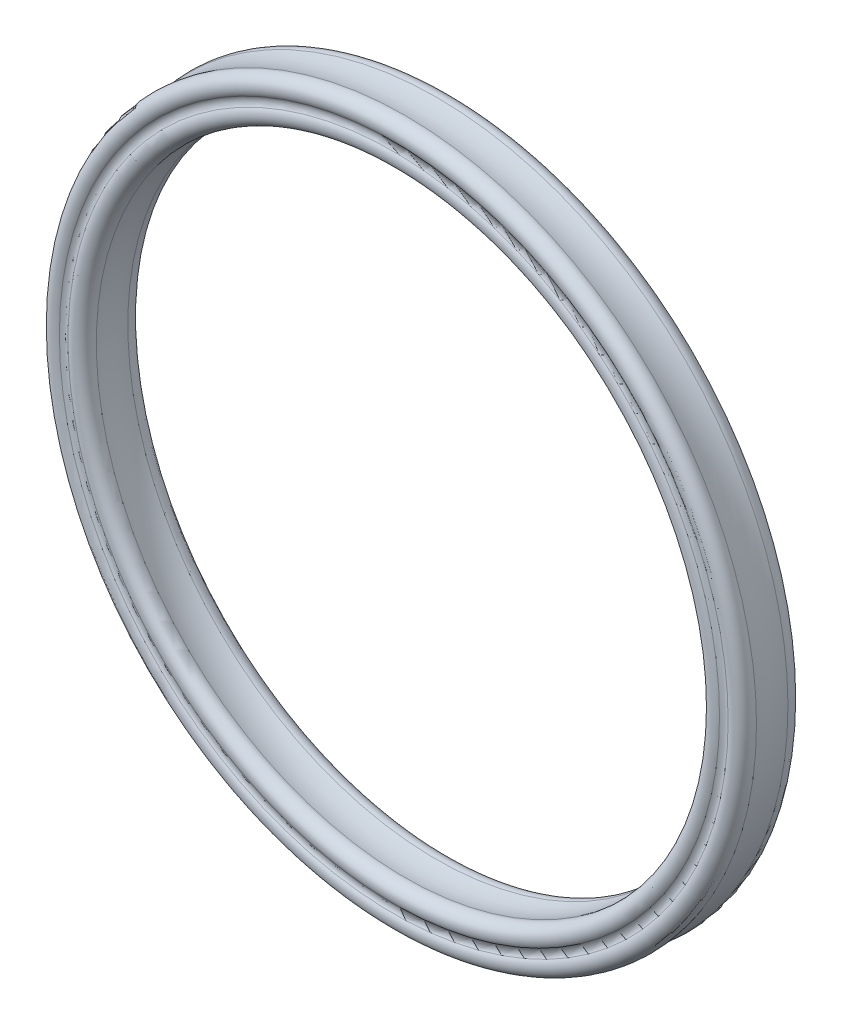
from build123d import *


with BuildPart() as part:
    # Esquisse1 → Base-R_volution (revolve)
    with BuildSketch(Plane(origin=(0, 0, 0), x_dir=(0, 0, -1), z_dir=(1, 0, 0)), mode=Mode.PRIVATE) as base_r_volution_sk:
        with BuildLine():
            ThreePointArc((1.394366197, 35.859881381), (0.191572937, 35.420290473), (0.22, 34.14))
            ThreePointArc((0.22, 34.14), (0.366666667, 33.7), (0.22, 33.26))
            ThreePointArc((0.22, 33.26), (0.191572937, 31.979709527), (1.394366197, 31.540118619))
            ThreePointArc((1.394366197, 31.540118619), (3, 31.758947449), (4.605633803, 31.540118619))
            ThreePointArc((4.605633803, 31.540118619), (5.808427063, 31.979709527), (5.78, 33.26))
            ThreePointArc((5.78, 33.26), (5.633333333, 33.7), (5.78, 34.14))
            ThreePointArc((5.78, 34.14), (5.808427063, 35.420290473), (4.605633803, 35.859881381))
            ThreePointArc((4.605633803, 35.859881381), (3, 35.641052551), (1.394366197, 35.859881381))
        make_face()
    revolve(base_r_volution_sk.sketch.rotate(Axis((0, 0, 0), (0, 0, -1)), 90), axis=Axis((0, 0, 0), (0, 0, -1)))


solid = part.part
